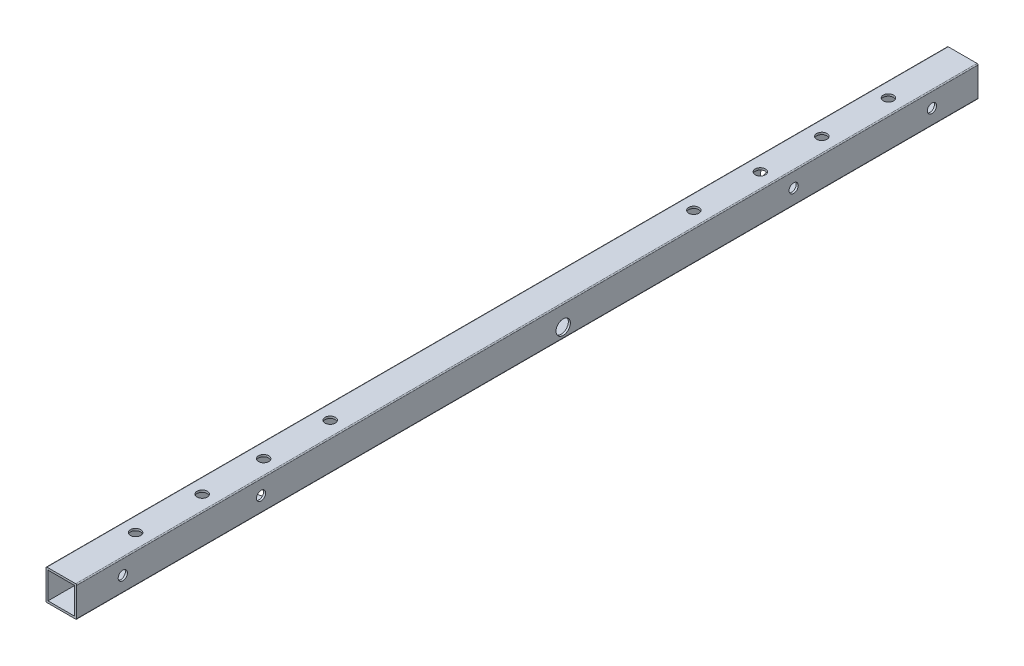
ISO-10303-21;
HEADER;
FILE_DESCRIPTION(('STEP AP214'),'2;1');
FILE_NAME('part.step','',(''),(''),'','','');
FILE_SCHEMA(('AUTOMOTIVE_DESIGN { 1 0 10303 214 1 1 1 1 }'));
ENDSEC;
DATA;
#1=APPLICATION_CONTEXT('core data for automotive mechanical design processes');
#2=APPLICATION_PROTOCOL_DEFINITION('international standard','automotive_design',2000,#1);
#3=PRODUCT_CONTEXT('',#1,'mechanical');
#4=PRODUCT('Part','Part','',(#3));
#5=PRODUCT_RELATED_PRODUCT_CATEGORY('part','',(#4));
#6=PRODUCT_DEFINITION_FORMATION('','',#4);
#7=PRODUCT_DEFINITION_CONTEXT('part definition',#1,'design');
#8=PRODUCT_DEFINITION('design','',#6,#7);
#9=PRODUCT_DEFINITION_SHAPE('','',#8);
#10=(LENGTH_UNIT() NAMED_UNIT(*) SI_UNIT(.MILLI.,.METRE.));
#11=(NAMED_UNIT(*) PLANE_ANGLE_UNIT() SI_UNIT($,.RADIAN.));
#12=(NAMED_UNIT(*) SI_UNIT($,.STERADIAN.) SOLID_ANGLE_UNIT());
#13=UNCERTAINTY_MEASURE_WITH_UNIT(LENGTH_MEASURE(1.E-05),#10,'distance_accuracy_value','');
#14=(GEOMETRIC_REPRESENTATION_CONTEXT(3) GLOBAL_UNCERTAINTY_ASSIGNED_CONTEXT((#13)) GLOBAL_UNIT_ASSIGNED_CONTEXT((#10,
#11,#12)) REPRESENTATION_CONTEXT('',''));
#15=CARTESIAN_POINT('',(0.,0.,0.));
#16=DIRECTION('',(0.,0.,1.));
#17=DIRECTION('',(1.,0.,0.));
#18=AXIS2_PLACEMENT_3D('',#15,#16,#17);
#19=CARTESIAN_POINT('',(-14.,-14.,0.));
#20=DIRECTION('',(0.,0.,-1.));
#21=DIRECTION('',(-1.,0.,0.));
#22=AXIS2_PLACEMENT_3D('',#19,#20,#21);
#23=PLANE('',#22);
#24=CARTESIAN_POINT('',(-14.,-14.,0.));
#25=DIRECTION('',(0.,0.,-1.));
#26=DIRECTION('',(-1.,0.,0.));
#27=AXIS2_PLACEMENT_3D('',#24,#25,#26);
#28=CIRCLE('',#27,0.999999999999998);
#29=CARTESIAN_POINT('',(-14.,-15.,0.));
#30=VERTEX_POINT('',#29);
#31=CARTESIAN_POINT('',(-15.,-14.,0.));
#32=VERTEX_POINT('',#31);
#33=EDGE_CURVE('E127',#30,#32,#28,.T.);
#34=ORIENTED_EDGE('',*,*,#33,.T.);
#35=DIRECTION('',(0.,-1.,0.));
#36=VECTOR('',#35,1.);
#37=CARTESIAN_POINT('',(-15.,14.,0.));
#38=LINE('',#37,#36);
#39=CARTESIAN_POINT('',(-15.,14.,0.));
#40=VERTEX_POINT('',#39);
#41=EDGE_CURVE('E163',#40,#32,#38,.T.);
#42=ORIENTED_EDGE('',*,*,#41,.F.);
#43=CARTESIAN_POINT('',(-14.,14.,0.));
#44=DIRECTION('',(0.,0.,-1.));
#45=DIRECTION('',(-1.,0.,0.));
#46=AXIS2_PLACEMENT_3D('',#43,#44,#45);
#47=CIRCLE('',#46,0.999999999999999);
#48=CARTESIAN_POINT('',(-14.,15.,0.));
#49=VERTEX_POINT('',#48);
#50=EDGE_CURVE('E166',#40,#49,#47,.T.);
#51=ORIENTED_EDGE('',*,*,#50,.T.);
#52=DIRECTION('',(1.,0.,0.));
#53=VECTOR('',#52,1.);
#54=CARTESIAN_POINT('',(-14.,15.,0.));
#55=LINE('',#54,#53);
#56=CARTESIAN_POINT('',(14.,15.,0.));
#57=VERTEX_POINT('',#56);
#58=EDGE_CURVE('E169',#49,#57,#55,.T.);
#59=ORIENTED_EDGE('',*,*,#58,.T.);
#60=CARTESIAN_POINT('',(14.,14.,0.));
#61=DIRECTION('',(0.,0.,1.));
#62=DIRECTION('',(1.,0.,0.));
#63=AXIS2_PLACEMENT_3D('',#60,#61,#62);
#64=CIRCLE('',#63,0.999999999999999);
#65=CARTESIAN_POINT('',(15.,14.,0.));
#66=VERTEX_POINT('',#65);
#67=EDGE_CURVE('E172',#66,#57,#64,.T.);
#68=ORIENTED_EDGE('',*,*,#67,.F.);
#69=DIRECTION('',(0.,1.,0.));
#70=VECTOR('',#69,1.);
#71=CARTESIAN_POINT('',(15.,-14.,0.));
#72=LINE('',#71,#70);
#73=CARTESIAN_POINT('',(15.,-14.,0.));
#74=VERTEX_POINT('',#73);
#75=EDGE_CURVE('E175',#74,#66,#72,.T.);
#76=ORIENTED_EDGE('',*,*,#75,.F.);
#77=CARTESIAN_POINT('',(14.,-14.,0.));
#78=DIRECTION('',(0.,0.,-1.));
#79=DIRECTION('',(-1.,0.,0.));
#80=AXIS2_PLACEMENT_3D('',#77,#78,#79);
#81=CIRCLE('',#80,1.);
#82=CARTESIAN_POINT('',(14.,-15.,0.));
#83=VERTEX_POINT('',#82);
#84=EDGE_CURVE('E177',#74,#83,#81,.T.);
#85=ORIENTED_EDGE('',*,*,#84,.T.);
#86=DIRECTION('',(-1.,0.,0.));
#87=VECTOR('',#86,1.);
#88=CARTESIAN_POINT('',(14.,-15.,0.));
#89=LINE('',#88,#87);
#90=EDGE_CURVE('E180',#83,#30,#89,.T.);
#91=ORIENTED_EDGE('',*,*,#90,.T.);
#92=EDGE_LOOP('',(#34,#42,#51,#59,#68,#76,#85,#91));
#93=FACE_BOUND('',#92,.T.);
#94=DIRECTION('',(1.,0.,0.));
#95=VECTOR('',#94,1.);
#96=CARTESIAN_POINT('',(-14.,13.,0.));
#97=LINE('',#96,#95);
#98=CARTESIAN_POINT('',(-13.,13.,0.));
#99=VERTEX_POINT('',#98);
#100=CARTESIAN_POINT('',(13.,13.,0.));
#101=VERTEX_POINT('',#100);
#102=EDGE_CURVE('E139',#99,#101,#97,.T.);
#103=ORIENTED_EDGE('',*,*,#102,.F.);
#104=DIRECTION('',(0.,-1.,0.));
#105=VECTOR('',#104,1.);
#106=CARTESIAN_POINT('',(-13.,-14.,0.));
#107=LINE('',#106,#105);
#108=CARTESIAN_POINT('',(-13.,-13.,0.));
#109=VERTEX_POINT('',#108);
#110=EDGE_CURVE('E55',#99,#109,#107,.T.);
#111=ORIENTED_EDGE('',*,*,#110,.T.);
#112=DIRECTION('',(-1.,0.,0.));
#113=VECTOR('',#112,1.);
#114=CARTESIAN_POINT('',(-14.,-13.,0.));
#115=LINE('',#114,#113);
#116=CARTESIAN_POINT('',(13.,-13.,0.));
#117=VERTEX_POINT('',#116);
#118=EDGE_CURVE('E131',#117,#109,#115,.T.);
#119=ORIENTED_EDGE('',*,*,#118,.F.);
#120=DIRECTION('',(0.,1.,0.));
#121=VECTOR('',#120,1.);
#122=CARTESIAN_POINT('',(13.,-14.,0.));
#123=LINE('',#122,#121);
#124=EDGE_CURVE('E136',#117,#101,#123,.T.);
#125=ORIENTED_EDGE('',*,*,#124,.T.);
#126=EDGE_LOOP('',(#103,#111,#119,#125));
#127=FACE_BOUND('',#126,.T.);
#128=ADVANCED_FACE('F30',(#93,#127),#23,.T.);
#129=CARTESIAN_POINT('',(-14.,-14.,880.));
#130=DIRECTION('',(0.,0.,-1.));
#131=DIRECTION('',(-1.,0.,0.));
#132=AXIS2_PLACEMENT_3D('',#129,#130,#131);
#133=CYLINDRICAL_SURFACE('',#132,0.999999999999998);
#134=ORIENTED_EDGE('',*,*,#33,.F.);
#135=DIRECTION('',(0.,0.,-1.));
#136=VECTOR('',#135,1.);
#137=CARTESIAN_POINT('',(-14.,-15.,880.));
#138=LINE('',#137,#136);
#139=CARTESIAN_POINT('',(-14.,-15.,880.));
#140=VERTEX_POINT('',#139);
#141=EDGE_CURVE('E11',#140,#30,#138,.T.);
#142=ORIENTED_EDGE('',*,*,#141,.F.);
#143=CARTESIAN_POINT('',(-14.,-14.,880.));
#144=DIRECTION('',(0.,0.,-1.));
#145=DIRECTION('',(-1.,0.,0.));
#146=AXIS2_PLACEMENT_3D('',#143,#144,#145);
#147=CIRCLE('',#146,0.999999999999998);
#148=CARTESIAN_POINT('',(-15.,-14.,880.));
#149=VERTEX_POINT('',#148);
#150=EDGE_CURVE('E183',#140,#149,#147,.T.);
#151=ORIENTED_EDGE('',*,*,#150,.T.);
#152=DIRECTION('',(0.,0.,-1.));
#153=VECTOR('',#152,1.);
#154=CARTESIAN_POINT('',(-15.,-14.,880.));
#155=LINE('',#154,#153);
#156=EDGE_CURVE('E203',#149,#32,#155,.T.);
#157=ORIENTED_EDGE('',*,*,#156,.T.);
#158=EDGE_LOOP('',(#134,#142,#151,#157));
#159=FACE_BOUND('',#158,.T.);
#160=ADVANCED_FACE('F32',(#159),#133,.T.);
#161=CARTESIAN_POINT('',(14.,-15.,880.));
#162=DIRECTION('',(0.,-1.,0.));
#163=DIRECTION('',(1.,0.,0.));
#164=AXIS2_PLACEMENT_3D('',#161,#162,#163);
#165=PLANE('',#164);
#166=CARTESIAN_POINT('',(0.,-15.,682.5));
#167=DIRECTION('',(0.,-1.,0.));
#168=DIRECTION('',(1.,0.,0.));
#169=AXIS2_PLACEMENT_3D('',#166,#167,#168);
#170=CIRCLE('',#169,5.);
#171=CARTESIAN_POINT('',(5.00000000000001,-15.,682.5));
#172=VERTEX_POINT('',#171);
#173=EDGE_CURVE('E302',#172,#172,#170,.T.);
#174=ORIENTED_EDGE('',*,*,#173,.F.);
#175=EDGE_LOOP('',(#174));
#176=FACE_BOUND('',#175,.T.);
#177=CARTESIAN_POINT('',(0.,-15.,617.5));
#178=DIRECTION('',(0.,-1.,0.));
#179=DIRECTION('',(1.,0.,0.));
#180=AXIS2_PLACEMENT_3D('',#177,#178,#179);
#181=CIRCLE('',#180,5.);
#182=CARTESIAN_POINT('',(5.00000000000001,-15.,617.5));
#183=VERTEX_POINT('',#182);
#184=EDGE_CURVE('E309',#183,#183,#181,.T.);
#185=ORIENTED_EDGE('',*,*,#184,.F.);
#186=EDGE_LOOP('',(#185));
#187=FACE_BOUND('',#186,.T.);
#188=CARTESIAN_POINT('',(0.,-15.,262.5));
#189=DIRECTION('',(0.,-1.,0.));
#190=DIRECTION('',(1.,0.,0.));
#191=AXIS2_PLACEMENT_3D('',#188,#189,#190);
#192=CIRCLE('',#191,5.);
#193=CARTESIAN_POINT('',(5.00000000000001,-15.,262.5));
#194=VERTEX_POINT('',#193);
#195=EDGE_CURVE('E316',#194,#194,#192,.T.);
#196=ORIENTED_EDGE('',*,*,#195,.F.);
#197=EDGE_LOOP('',(#196));
#198=FACE_BOUND('',#197,.T.);
#199=CARTESIAN_POINT('',(0.,-15.,197.5));
#200=DIRECTION('',(0.,-1.,0.));
#201=DIRECTION('',(1.,0.,0.));
#202=AXIS2_PLACEMENT_3D('',#199,#200,#201);
#203=CIRCLE('',#202,5.);
#204=CARTESIAN_POINT('',(5.00000000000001,-15.,197.5));
#205=VERTEX_POINT('',#204);
#206=EDGE_CURVE('E323',#205,#205,#203,.T.);
#207=ORIENTED_EDGE('',*,*,#206,.F.);
#208=EDGE_LOOP('',(#207));
#209=FACE_BOUND('',#208,.T.);
#210=CARTESIAN_POINT('',(0.,-15.,807.5));
#211=DIRECTION('',(0.,-1.,0.));
#212=DIRECTION('',(1.,0.,0.));
#213=AXIS2_PLACEMENT_3D('',#210,#211,#212);
#214=CIRCLE('',#213,5.);
#215=CARTESIAN_POINT('',(5.00000000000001,-15.,807.5));
#216=VERTEX_POINT('',#215);
#217=EDGE_CURVE('E330',#216,#216,#214,.T.);
#218=ORIENTED_EDGE('',*,*,#217,.F.);
#219=EDGE_LOOP('',(#218));
#220=FACE_BOUND('',#219,.T.);
#221=CARTESIAN_POINT('',(0.,-15.,742.5));
#222=DIRECTION('',(0.,-1.,0.));
#223=DIRECTION('',(1.,0.,0.));
#224=AXIS2_PLACEMENT_3D('',#221,#222,#223);
#225=CIRCLE('',#224,5.);
#226=CARTESIAN_POINT('',(5.00000000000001,-15.,742.5));
#227=VERTEX_POINT('',#226);
#228=EDGE_CURVE('E337',#227,#227,#225,.T.);
#229=ORIENTED_EDGE('',*,*,#228,.F.);
#230=EDGE_LOOP('',(#229));
#231=FACE_BOUND('',#230,.T.);
#232=CARTESIAN_POINT('',(0.,-15.,137.5));
#233=DIRECTION('',(0.,-1.,0.));
#234=DIRECTION('',(1.,0.,0.));
#235=AXIS2_PLACEMENT_3D('',#232,#233,#234);
#236=CIRCLE('',#235,5.);
#237=CARTESIAN_POINT('',(5.00000000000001,-15.,137.5));
#238=VERTEX_POINT('',#237);
#239=EDGE_CURVE('E344',#238,#238,#236,.T.);
#240=ORIENTED_EDGE('',*,*,#239,.F.);
#241=EDGE_LOOP('',(#240));
#242=FACE_BOUND('',#241,.T.);
#243=CARTESIAN_POINT('',(0.,-15.,72.5));
#244=DIRECTION('',(0.,-1.,0.));
#245=DIRECTION('',(1.,0.,0.));
#246=AXIS2_PLACEMENT_3D('',#243,#244,#245);
#247=CIRCLE('',#246,5.);
#248=CARTESIAN_POINT('',(5.00000000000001,-15.,72.5));
#249=VERTEX_POINT('',#248);
#250=EDGE_CURVE('E140',#249,#249,#247,.T.);
#251=ORIENTED_EDGE('',*,*,#250,.F.);
#252=EDGE_LOOP('',(#251));
#253=FACE_BOUND('',#252,.T.);
#254=ORIENTED_EDGE('',*,*,#90,.F.);
#255=DIRECTION('',(0.,0.,-1.));
#256=VECTOR('',#255,1.);
#257=CARTESIAN_POINT('',(14.,-15.,880.));
#258=LINE('',#257,#256);
#259=CARTESIAN_POINT('',(14.,-15.,880.));
#260=VERTEX_POINT('',#259);
#261=EDGE_CURVE('E39',#260,#83,#258,.T.);
#262=ORIENTED_EDGE('',*,*,#261,.F.);
#263=DIRECTION('',(-1.,0.,0.));
#264=VECTOR('',#263,1.);
#265=CARTESIAN_POINT('',(14.,-15.,880.));
#266=LINE('',#265,#264);
#267=EDGE_CURVE('E201',#260,#140,#266,.T.);
#268=ORIENTED_EDGE('',*,*,#267,.T.);
#269=ORIENTED_EDGE('',*,*,#141,.T.);
#270=EDGE_LOOP('',(#254,#262,#268,#269));
#271=FACE_BOUND('',#270,.T.);
#272=ADVANCED_FACE('F374',(#176,#187,#198,#209,#220,#231,#242,#253,#271),#165,.T.);
#273=CARTESIAN_POINT('',(14.,-14.,880.));
#274=DIRECTION('',(0.,0.,-1.));
#275=DIRECTION('',(-1.,0.,0.));
#276=AXIS2_PLACEMENT_3D('',#273,#274,#275);
#277=CYLINDRICAL_SURFACE('',#276,1.);
#278=ORIENTED_EDGE('',*,*,#84,.F.);
#279=DIRECTION('',(0.,0.,-1.));
#280=VECTOR('',#279,1.);
#281=CARTESIAN_POINT('',(15.,-14.,880.));
#282=LINE('',#281,#280);
#283=CARTESIAN_POINT('',(15.,-14.,880.));
#284=VERTEX_POINT('',#283);
#285=EDGE_CURVE('E206',#284,#74,#282,.T.);
#286=ORIENTED_EDGE('',*,*,#285,.F.);
#287=CARTESIAN_POINT('',(14.,-14.,880.));
#288=DIRECTION('',(0.,0.,-1.));
#289=DIRECTION('',(-1.,0.,0.));
#290=AXIS2_PLACEMENT_3D('',#287,#288,#289);
#291=CIRCLE('',#290,1.);
#292=EDGE_CURVE('E198',#284,#260,#291,.T.);
#293=ORIENTED_EDGE('',*,*,#292,.T.);
#294=ORIENTED_EDGE('',*,*,#261,.T.);
#295=EDGE_LOOP('',(#278,#286,#293,#294));
#296=FACE_BOUND('',#295,.T.);
#297=ADVANCED_FACE('F386',(#296),#277,.T.);
#298=CARTESIAN_POINT('',(15.,-14.,880.));
#299=DIRECTION('',(-1.,0.,0.));
#300=DIRECTION('',(0.,-1.,0.));
#301=AXIS2_PLACEMENT_3D('',#298,#299,#300);
#302=PLANE('',#301);
#303=CARTESIAN_POINT('',(15.,-5.,405.));
#304=DIRECTION('',(1.,0.,0.));
#305=DIRECTION('',(0.,1.,0.));
#306=AXIS2_PLACEMENT_3D('',#303,#304,#305);
#307=CIRCLE('',#306,6.99999999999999);
#308=CARTESIAN_POINT('',(15.,1.99999999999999,405.));
#309=VERTEX_POINT('',#308);
#310=EDGE_CURVE('E704',#309,#309,#307,.T.);
#311=ORIENTED_EDGE('',*,*,#310,.F.);
#312=EDGE_LOOP('',(#311));
#313=FACE_BOUND('',#312,.T.);
#314=CARTESIAN_POINT('',(15.,0.,180.));
#315=DIRECTION('',(-1.,0.,0.));
#316=DIRECTION('',(0.,-1.,0.));
#317=AXIS2_PLACEMENT_3D('',#314,#315,#316);
#318=CIRCLE('',#317,4.49999999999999);
#319=CARTESIAN_POINT('',(15.,-4.49999999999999,180.));
#320=VERTEX_POINT('',#319);
#321=EDGE_CURVE('E713',#320,#320,#318,.T.);
#322=ORIENTED_EDGE('',*,*,#321,.T.);
#323=EDGE_LOOP('',(#322));
#324=FACE_BOUND('',#323,.T.);
#325=CARTESIAN_POINT('',(15.,0.,45.));
#326=DIRECTION('',(-1.,0.,0.));
#327=DIRECTION('',(0.,-1.,0.));
#328=AXIS2_PLACEMENT_3D('',#325,#326,#327);
#329=CIRCLE('',#328,4.5);
#330=CARTESIAN_POINT('',(15.,-4.5,45.));
#331=VERTEX_POINT('',#330);
#332=EDGE_CURVE('E269',#331,#331,#329,.T.);
#333=ORIENTED_EDGE('',*,*,#332,.T.);
#334=EDGE_LOOP('',(#333));
#335=FACE_BOUND('',#334,.T.);
#336=CARTESIAN_POINT('',(15.,0.,700.));
#337=DIRECTION('',(-1.,0.,0.));
#338=DIRECTION('',(0.,-1.,0.));
#339=AXIS2_PLACEMENT_3D('',#336,#337,#338);
#340=CIRCLE('',#339,4.49999999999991);
#341=CARTESIAN_POINT('',(15.,-4.49999999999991,700.));
#342=VERTEX_POINT('',#341);
#343=EDGE_CURVE('E265',#342,#342,#340,.T.);
#344=ORIENTED_EDGE('',*,*,#343,.T.);
#345=EDGE_LOOP('',(#344));
#346=FACE_BOUND('',#345,.T.);
#347=CARTESIAN_POINT('',(15.,0.,835.));
#348=DIRECTION('',(-1.,0.,0.));
#349=DIRECTION('',(0.,-1.,0.));
#350=AXIS2_PLACEMENT_3D('',#347,#348,#349);
#351=CIRCLE('',#350,4.49999999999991);
#352=CARTESIAN_POINT('',(15.,-4.49999999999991,835.));
#353=VERTEX_POINT('',#352);
#354=EDGE_CURVE('E261',#353,#353,#351,.T.);
#355=ORIENTED_EDGE('',*,*,#354,.T.);
#356=EDGE_LOOP('',(#355));
#357=FACE_BOUND('',#356,.T.);
#358=ORIENTED_EDGE('',*,*,#75,.T.);
#359=DIRECTION('',(0.,0.,-1.));
#360=VECTOR('',#359,1.);
#361=CARTESIAN_POINT('',(15.,14.,880.));
#362=LINE('',#361,#360);
#363=CARTESIAN_POINT('',(15.,14.,880.));
#364=VERTEX_POINT('',#363);
#365=EDGE_CURVE('E208',#364,#66,#362,.T.);
#366=ORIENTED_EDGE('',*,*,#365,.F.);
#367=DIRECTION('',(0.,1.,0.));
#368=VECTOR('',#367,1.);
#369=CARTESIAN_POINT('',(15.,-14.,880.));
#370=LINE('',#369,#368);
#371=EDGE_CURVE('E196',#284,#364,#370,.T.);
#372=ORIENTED_EDGE('',*,*,#371,.F.);
#373=ORIENTED_EDGE('',*,*,#285,.T.);
#374=EDGE_LOOP('',(#358,#366,#372,#373));
#375=FACE_BOUND('',#374,.T.);
#376=ADVANCED_FACE('F390',(#313,#324,#335,#346,#357,#375),#302,.F.);
#377=CARTESIAN_POINT('',(14.,14.,880.));
#378=DIRECTION('',(0.,0.,-1.));
#379=DIRECTION('',(-1.,0.,0.));
#380=AXIS2_PLACEMENT_3D('',#377,#378,#379);
#381=CYLINDRICAL_SURFACE('',#380,0.999999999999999);
#382=ORIENTED_EDGE('',*,*,#67,.T.);
#383=DIRECTION('',(0.,0.,-1.));
#384=VECTOR('',#383,1.);
#385=CARTESIAN_POINT('',(14.,15.,880.));
#386=LINE('',#385,#384);
#387=CARTESIAN_POINT('',(14.,15.,880.));
#388=VERTEX_POINT('',#387);
#389=EDGE_CURVE('E211',#388,#57,#386,.T.);
#390=ORIENTED_EDGE('',*,*,#389,.F.);
#391=CARTESIAN_POINT('',(14.,14.,880.));
#392=DIRECTION('',(0.,0.,1.));
#393=DIRECTION('',(1.,0.,0.));
#394=AXIS2_PLACEMENT_3D('',#391,#392,#393);
#395=CIRCLE('',#394,0.999999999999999);
#396=EDGE_CURVE('E194',#364,#388,#395,.T.);
#397=ORIENTED_EDGE('',*,*,#396,.F.);
#398=ORIENTED_EDGE('',*,*,#365,.T.);
#399=EDGE_LOOP('',(#382,#390,#397,#398));
#400=FACE_BOUND('',#399,.T.);
#401=ADVANCED_FACE('F394',(#400),#381,.T.);
#402=CARTESIAN_POINT('',(-14.,15.,880.));
#403=DIRECTION('',(0.,1.,0.));
#404=DIRECTION('',(0.,0.,1.));
#405=AXIS2_PLACEMENT_3D('',#402,#403,#404);
#406=PLANE('',#405);
#407=CARTESIAN_POINT('',(0.,15.,682.5));
#408=DIRECTION('',(0.,1.,0.));
#409=DIRECTION('',(0.,0.,1.));
#410=AXIS2_PLACEMENT_3D('',#407,#408,#409);
#411=CIRCLE('',#410,5.);
#412=CARTESIAN_POINT('',(0.,15.,687.5));
#413=VERTEX_POINT('',#412);
#414=EDGE_CURVE('E256',#413,#413,#411,.T.);
#415=ORIENTED_EDGE('',*,*,#414,.F.);
#416=EDGE_LOOP('',(#415));
#417=FACE_BOUND('',#416,.T.);
#418=CARTESIAN_POINT('',(0.,15.,617.5));
#419=DIRECTION('',(0.,1.,0.));
#420=DIRECTION('',(0.,0.,1.));
#421=AXIS2_PLACEMENT_3D('',#418,#419,#420);
#422=CIRCLE('',#421,5.);
#423=CARTESIAN_POINT('',(0.,15.,622.5));
#424=VERTEX_POINT('',#423);
#425=EDGE_CURVE('E251',#424,#424,#422,.T.);
#426=ORIENTED_EDGE('',*,*,#425,.F.);
#427=EDGE_LOOP('',(#426));
#428=FACE_BOUND('',#427,.T.);
#429=CARTESIAN_POINT('',(0.,15.,262.5));
#430=DIRECTION('',(0.,1.,0.));
#431=DIRECTION('',(0.,0.,1.));
#432=AXIS2_PLACEMENT_3D('',#429,#430,#431);
#433=CIRCLE('',#432,5.);
#434=CARTESIAN_POINT('',(0.,15.,267.5));
#435=VERTEX_POINT('',#434);
#436=EDGE_CURVE('E246',#435,#435,#433,.T.);
#437=ORIENTED_EDGE('',*,*,#436,.F.);
#438=EDGE_LOOP('',(#437));
#439=FACE_BOUND('',#438,.T.);
#440=CARTESIAN_POINT('',(0.,15.,197.5));
#441=DIRECTION('',(0.,1.,0.));
#442=DIRECTION('',(0.,0.,1.));
#443=AXIS2_PLACEMENT_3D('',#440,#441,#442);
#444=CIRCLE('',#443,5.);
#445=CARTESIAN_POINT('',(0.,15.,202.5));
#446=VERTEX_POINT('',#445);
#447=EDGE_CURVE('E241',#446,#446,#444,.T.);
#448=ORIENTED_EDGE('',*,*,#447,.F.);
#449=EDGE_LOOP('',(#448));
#450=FACE_BOUND('',#449,.T.);
#451=CARTESIAN_POINT('',(0.,15.,807.5));
#452=DIRECTION('',(0.,1.,0.));
#453=DIRECTION('',(0.,0.,1.));
#454=AXIS2_PLACEMENT_3D('',#451,#452,#453);
#455=CIRCLE('',#454,5.);
#456=CARTESIAN_POINT('',(0.,15.,812.5));
#457=VERTEX_POINT('',#456);
#458=EDGE_CURVE('E236',#457,#457,#455,.T.);
#459=ORIENTED_EDGE('',*,*,#458,.F.);
#460=EDGE_LOOP('',(#459));
#461=FACE_BOUND('',#460,.T.);
#462=CARTESIAN_POINT('',(0.,15.,742.5));
#463=DIRECTION('',(0.,1.,0.));
#464=DIRECTION('',(0.,0.,1.));
#465=AXIS2_PLACEMENT_3D('',#462,#463,#464);
#466=CIRCLE('',#465,5.);
#467=CARTESIAN_POINT('',(0.,15.,747.5));
#468=VERTEX_POINT('',#467);
#469=EDGE_CURVE('E231',#468,#468,#466,.T.);
#470=ORIENTED_EDGE('',*,*,#469,.F.);
#471=EDGE_LOOP('',(#470));
#472=FACE_BOUND('',#471,.T.);
#473=CARTESIAN_POINT('',(0.,15.,137.5));
#474=DIRECTION('',(0.,1.,0.));
#475=DIRECTION('',(0.,0.,1.));
#476=AXIS2_PLACEMENT_3D('',#473,#474,#475);
#477=CIRCLE('',#476,5.);
#478=CARTESIAN_POINT('',(0.,15.,142.5));
#479=VERTEX_POINT('',#478);
#480=EDGE_CURVE('E226',#479,#479,#477,.T.);
#481=ORIENTED_EDGE('',*,*,#480,.F.);
#482=EDGE_LOOP('',(#481));
#483=FACE_BOUND('',#482,.T.);
#484=CARTESIAN_POINT('',(0.,15.,72.5));
#485=DIRECTION('',(0.,1.,0.));
#486=DIRECTION('',(0.,0.,1.));
#487=AXIS2_PLACEMENT_3D('',#484,#485,#486);
#488=CIRCLE('',#487,5.);
#489=CARTESIAN_POINT('',(0.,15.,77.5));
#490=VERTEX_POINT('',#489);
#491=EDGE_CURVE('E221',#490,#490,#488,.T.);
#492=ORIENTED_EDGE('',*,*,#491,.F.);
#493=EDGE_LOOP('',(#492));
#494=FACE_BOUND('',#493,.T.);
#495=ORIENTED_EDGE('',*,*,#58,.F.);
#496=DIRECTION('',(0.,0.,-1.));
#497=VECTOR('',#496,1.);
#498=CARTESIAN_POINT('',(-14.,15.,880.));
#499=LINE('',#498,#497);
#500=CARTESIAN_POINT('',(-14.,15.,880.));
#501=VERTEX_POINT('',#500);
#502=EDGE_CURVE('E213',#501,#49,#499,.T.);
#503=ORIENTED_EDGE('',*,*,#502,.F.);
#504=DIRECTION('',(1.,0.,0.));
#505=VECTOR('',#504,1.);
#506=CARTESIAN_POINT('',(-14.,15.,880.));
#507=LINE('',#506,#505);
#508=EDGE_CURVE('E191',#501,#388,#507,.T.);
#509=ORIENTED_EDGE('',*,*,#508,.T.);
#510=ORIENTED_EDGE('',*,*,#389,.T.);
#511=EDGE_LOOP('',(#495,#503,#509,#510));
#512=FACE_BOUND('',#511,.T.);
#513=ADVANCED_FACE('F398',(#417,#428,#439,#450,#461,#472,#483,#494,#512),#406,.T.);
#514=CARTESIAN_POINT('',(-14.,14.,880.));
#515=DIRECTION('',(0.,0.,-1.));
#516=DIRECTION('',(-1.,0.,0.));
#517=AXIS2_PLACEMENT_3D('',#514,#515,#516);
#518=CYLINDRICAL_SURFACE('',#517,0.999999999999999);
#519=ORIENTED_EDGE('',*,*,#50,.F.);
#520=DIRECTION('',(0.,0.,-1.));
#521=VECTOR('',#520,1.);
#522=CARTESIAN_POINT('',(-15.,14.,880.));
#523=LINE('',#522,#521);
#524=CARTESIAN_POINT('',(-15.,14.,880.));
#525=VERTEX_POINT('',#524);
#526=EDGE_CURVE('E215',#525,#40,#523,.T.);
#527=ORIENTED_EDGE('',*,*,#526,.F.);
#528=CARTESIAN_POINT('',(-14.,14.,880.));
#529=DIRECTION('',(0.,0.,-1.));
#530=DIRECTION('',(-1.,0.,0.));
#531=AXIS2_PLACEMENT_3D('',#528,#529,#530);
#532=CIRCLE('',#531,0.999999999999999);
#533=EDGE_CURVE('E188',#525,#501,#532,.T.);
#534=ORIENTED_EDGE('',*,*,#533,.T.);
#535=ORIENTED_EDGE('',*,*,#502,.T.);
#536=EDGE_LOOP('',(#519,#527,#534,#535));
#537=FACE_BOUND('',#536,.T.);
#538=ADVANCED_FACE('F402',(#537),#518,.T.);
#539=CARTESIAN_POINT('',(-15.,14.,880.));
#540=DIRECTION('',(1.,0.,0.));
#541=DIRECTION('',(0.,1.,0.));
#542=AXIS2_PLACEMENT_3D('',#539,#540,#541);
#543=PLANE('',#542);
#544=CARTESIAN_POINT('',(-15.,-5.,405.));
#545=DIRECTION('',(-1.,0.,0.));
#546=DIRECTION('',(0.,-1.,0.));
#547=AXIS2_PLACEMENT_3D('',#544,#545,#546);
#548=CIRCLE('',#547,4.50000000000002);
#549=CARTESIAN_POINT('',(-15.,-9.50000000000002,405.));
#550=VERTEX_POINT('',#549);
#551=EDGE_CURVE('E413',#550,#550,#548,.T.);
#552=ORIENTED_EDGE('',*,*,#551,.F.);
#553=EDGE_LOOP('',(#552));
#554=FACE_BOUND('',#553,.T.);
#555=CARTESIAN_POINT('',(-15.,0.,180.));
#556=DIRECTION('',(-1.,0.,0.));
#557=DIRECTION('',(0.,-1.,0.));
#558=AXIS2_PLACEMENT_3D('',#555,#556,#557);
#559=CIRCLE('',#558,4.49999999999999);
#560=CARTESIAN_POINT('',(-15.,-4.49999999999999,180.));
#561=VERTEX_POINT('',#560);
#562=EDGE_CURVE('E417',#561,#561,#559,.T.);
#563=ORIENTED_EDGE('',*,*,#562,.F.);
#564=EDGE_LOOP('',(#563));
#565=FACE_BOUND('',#564,.T.);
#566=CARTESIAN_POINT('',(-15.,0.,45.));
#567=DIRECTION('',(-1.,0.,0.));
#568=DIRECTION('',(0.,-1.,0.));
#569=AXIS2_PLACEMENT_3D('',#566,#567,#568);
#570=CIRCLE('',#569,4.5);
#571=CARTESIAN_POINT('',(-15.,-4.49999999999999,45.));
#572=VERTEX_POINT('',#571);
#573=EDGE_CURVE('E276',#572,#572,#570,.T.);
#574=ORIENTED_EDGE('',*,*,#573,.F.);
#575=EDGE_LOOP('',(#574));
#576=FACE_BOUND('',#575,.T.);
#577=CARTESIAN_POINT('',(-15.,0.,700.));
#578=DIRECTION('',(-1.,0.,0.));
#579=DIRECTION('',(0.,-1.,0.));
#580=AXIS2_PLACEMENT_3D('',#577,#578,#579);
#581=CIRCLE('',#580,4.49999999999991);
#582=CARTESIAN_POINT('',(-15.,-4.4999999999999,700.));
#583=VERTEX_POINT('',#582);
#584=EDGE_CURVE('E273',#583,#583,#581,.T.);
#585=ORIENTED_EDGE('',*,*,#584,.F.);
#586=EDGE_LOOP('',(#585));
#587=FACE_BOUND('',#586,.T.);
#588=CARTESIAN_POINT('',(-15.,0.,835.));
#589=DIRECTION('',(-1.,0.,0.));
#590=DIRECTION('',(0.,-1.,0.));
#591=AXIS2_PLACEMENT_3D('',#588,#589,#590);
#592=CIRCLE('',#591,4.49999999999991);
#593=CARTESIAN_POINT('',(-15.,-4.4999999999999,835.));
#594=VERTEX_POINT('',#593);
#595=EDGE_CURVE('E291',#594,#594,#592,.T.);
#596=ORIENTED_EDGE('',*,*,#595,.F.);
#597=EDGE_LOOP('',(#596));
#598=FACE_BOUND('',#597,.T.);
#599=ORIENTED_EDGE('',*,*,#41,.T.);
#600=ORIENTED_EDGE('',*,*,#156,.F.);
#601=DIRECTION('',(0.,-1.,0.));
#602=VECTOR('',#601,1.);
#603=CARTESIAN_POINT('',(-15.,14.,880.));
#604=LINE('',#603,#602);
#605=EDGE_CURVE('E186',#525,#149,#604,.T.);
#606=ORIENTED_EDGE('',*,*,#605,.F.);
#607=ORIENTED_EDGE('',*,*,#526,.T.);
#608=EDGE_LOOP('',(#599,#600,#606,#607));
#609=FACE_BOUND('',#608,.T.);
#610=ADVANCED_FACE('F382',(#554,#565,#576,#587,#598,#609),#543,.F.);
#611=CARTESIAN_POINT('',(-14.,-14.,880.));
#612=DIRECTION('',(0.,0.,-1.));
#613=DIRECTION('',(-1.,0.,0.));
#614=AXIS2_PLACEMENT_3D('',#611,#612,#613);
#615=PLANE('',#614);
#616=DIRECTION('',(0.,1.,0.));
#617=VECTOR('',#616,1.);
#618=CARTESIAN_POINT('',(13.,-14.,880.));
#619=LINE('',#618,#617);
#620=CARTESIAN_POINT('',(13.,-13.,880.));
#621=VERTEX_POINT('',#620);
#622=CARTESIAN_POINT('',(13.,13.,880.));
#623=VERTEX_POINT('',#622);
#624=EDGE_CURVE('E152',#621,#623,#619,.T.);
#625=ORIENTED_EDGE('',*,*,#624,.F.);
#626=DIRECTION('',(-1.,0.,0.));
#627=VECTOR('',#626,1.);
#628=CARTESIAN_POINT('',(-14.,-13.,880.));
#629=LINE('',#628,#627);
#630=CARTESIAN_POINT('',(-13.,-13.,880.));
#631=VERTEX_POINT('',#630);
#632=EDGE_CURVE('E150',#621,#631,#629,.T.);
#633=ORIENTED_EDGE('',*,*,#632,.T.);
#634=DIRECTION('',(0.,-1.,0.));
#635=VECTOR('',#634,1.);
#636=CARTESIAN_POINT('',(-13.,-14.,880.));
#637=LINE('',#636,#635);
#638=CARTESIAN_POINT('',(-13.,13.,880.));
#639=VERTEX_POINT('',#638);
#640=EDGE_CURVE('E123',#639,#631,#637,.T.);
#641=ORIENTED_EDGE('',*,*,#640,.F.);
#642=DIRECTION('',(1.,0.,0.));
#643=VECTOR('',#642,1.);
#644=CARTESIAN_POINT('',(-14.,13.,880.));
#645=LINE('',#644,#643);
#646=EDGE_CURVE('E154',#639,#623,#645,.T.);
#647=ORIENTED_EDGE('',*,*,#646,.T.);
#648=EDGE_LOOP('',(#625,#633,#641,#647));
#649=FACE_BOUND('',#648,.T.);
#650=ORIENTED_EDGE('',*,*,#150,.F.);
#651=ORIENTED_EDGE('',*,*,#267,.F.);
#652=ORIENTED_EDGE('',*,*,#292,.F.);
#653=ORIENTED_EDGE('',*,*,#371,.T.);
#654=ORIENTED_EDGE('',*,*,#396,.T.);
#655=ORIENTED_EDGE('',*,*,#508,.F.);
#656=ORIENTED_EDGE('',*,*,#533,.F.);
#657=ORIENTED_EDGE('',*,*,#605,.T.);
#658=EDGE_LOOP('',(#650,#651,#652,#653,#654,#655,#656,#657));
#659=FACE_BOUND('',#658,.T.);
#660=ADVANCED_FACE('F379',(#649,#659),#615,.F.);
#661=CARTESIAN_POINT('',(-13.,-14.,880.));
#662=DIRECTION('',(1.,0.,0.));
#663=DIRECTION('',(0.,1.,0.));
#664=AXIS2_PLACEMENT_3D('',#661,#662,#663);
#665=PLANE('',#664);
#666=CARTESIAN_POINT('',(-13.,-5.,405.));
#667=DIRECTION('',(1.,0.,0.));
#668=DIRECTION('',(0.,1.,0.));
#669=AXIS2_PLACEMENT_3D('',#666,#667,#668);
#670=CIRCLE('',#669,4.50000000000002);
#671=CARTESIAN_POINT('',(-13.,-0.49999999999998,405.));
#672=VERTEX_POINT('',#671);
#673=EDGE_CURVE('E709',#672,#672,#670,.T.);
#674=ORIENTED_EDGE('',*,*,#673,.F.);
#675=EDGE_LOOP('',(#674));
#676=FACE_BOUND('',#675,.T.);
#677=CARTESIAN_POINT('',(-13.,0.,180.));
#678=DIRECTION('',(1.,0.,0.));
#679=DIRECTION('',(0.,1.,0.));
#680=AXIS2_PLACEMENT_3D('',#677,#678,#679);
#681=CIRCLE('',#680,4.49999999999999);
#682=CARTESIAN_POINT('',(-13.,4.5,180.));
#683=VERTEX_POINT('',#682);
#684=EDGE_CURVE('E281',#683,#683,#681,.T.);
#685=ORIENTED_EDGE('',*,*,#684,.F.);
#686=EDGE_LOOP('',(#685));
#687=FACE_BOUND('',#686,.T.);
#688=CARTESIAN_POINT('',(-13.,0.,45.));
#689=DIRECTION('',(1.,0.,0.));
#690=DIRECTION('',(0.,1.,0.));
#691=AXIS2_PLACEMENT_3D('',#688,#689,#690);
#692=CIRCLE('',#691,4.5);
#693=CARTESIAN_POINT('',(-13.,4.5,45.));
#694=VERTEX_POINT('',#693);
#695=EDGE_CURVE('E268',#694,#694,#692,.T.);
#696=ORIENTED_EDGE('',*,*,#695,.F.);
#697=EDGE_LOOP('',(#696));
#698=FACE_BOUND('',#697,.T.);
#699=CARTESIAN_POINT('',(-13.,0.,700.));
#700=DIRECTION('',(1.,0.,0.));
#701=DIRECTION('',(0.,1.,0.));
#702=AXIS2_PLACEMENT_3D('',#699,#700,#701);
#703=CIRCLE('',#702,4.49999999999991);
#704=CARTESIAN_POINT('',(-13.,4.49999999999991,700.));
#705=VERTEX_POINT('',#704);
#706=EDGE_CURVE('E264',#705,#705,#703,.T.);
#707=ORIENTED_EDGE('',*,*,#706,.F.);
#708=EDGE_LOOP('',(#707));
#709=FACE_BOUND('',#708,.T.);
#710=CARTESIAN_POINT('',(-13.,0.,835.));
#711=DIRECTION('',(1.,0.,0.));
#712=DIRECTION('',(0.,1.,0.));
#713=AXIS2_PLACEMENT_3D('',#710,#711,#712);
#714=CIRCLE('',#713,4.49999999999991);
#715=CARTESIAN_POINT('',(-13.,4.49999999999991,835.));
#716=VERTEX_POINT('',#715);
#717=EDGE_CURVE('E260',#716,#716,#714,.T.);
#718=ORIENTED_EDGE('',*,*,#717,.F.);
#719=EDGE_LOOP('',(#718));
#720=FACE_BOUND('',#719,.T.);
#721=ORIENTED_EDGE('',*,*,#110,.F.);
#722=DIRECTION('',(0.,0.,-1.));
#723=VECTOR('',#722,1.);
#724=CARTESIAN_POINT('',(-13.,13.,880.));
#725=LINE('',#724,#723);
#726=EDGE_CURVE('E157',#639,#99,#725,.T.);
#727=ORIENTED_EDGE('',*,*,#726,.F.);
#728=ORIENTED_EDGE('',*,*,#640,.T.);
#729=DIRECTION('',(0.,0.,-1.));
#730=VECTOR('',#729,1.);
#731=CARTESIAN_POINT('',(-13.,-13.,880.));
#732=LINE('',#731,#730);
#733=EDGE_CURVE('E119',#631,#109,#732,.T.);
#734=ORIENTED_EDGE('',*,*,#733,.T.);
#735=EDGE_LOOP('',(#721,#727,#728,#734));
#736=FACE_BOUND('',#735,.T.);
#737=ADVANCED_FACE('F121',(#676,#687,#698,#709,#720,#736),#665,.T.);
#738=CARTESIAN_POINT('',(-14.,-13.,880.));
#739=DIRECTION('',(0.,-1.,0.));
#740=DIRECTION('',(1.,0.,0.));
#741=AXIS2_PLACEMENT_3D('',#738,#739,#740);
#742=PLANE('',#741);
#743=CARTESIAN_POINT('',(0.,-13.,682.5));
#744=DIRECTION('',(0.,-1.,0.));
#745=DIRECTION('',(1.,0.,0.));
#746=AXIS2_PLACEMENT_3D('',#743,#744,#745);
#747=CIRCLE('',#746,5.);
#748=CARTESIAN_POINT('',(5.00000000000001,-13.,682.5));
#749=VERTEX_POINT('',#748);
#750=EDGE_CURVE('E255',#749,#749,#747,.T.);
#751=ORIENTED_EDGE('',*,*,#750,.T.);
#752=EDGE_LOOP('',(#751));
#753=FACE_BOUND('',#752,.T.);
#754=CARTESIAN_POINT('',(0.,-13.,617.5));
#755=DIRECTION('',(0.,-1.,0.));
#756=DIRECTION('',(1.,0.,0.));
#757=AXIS2_PLACEMENT_3D('',#754,#755,#756);
#758=CIRCLE('',#757,5.);
#759=CARTESIAN_POINT('',(5.00000000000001,-13.,617.5));
#760=VERTEX_POINT('',#759);
#761=EDGE_CURVE('E250',#760,#760,#758,.T.);
#762=ORIENTED_EDGE('',*,*,#761,.T.);
#763=EDGE_LOOP('',(#762));
#764=FACE_BOUND('',#763,.T.);
#765=CARTESIAN_POINT('',(0.,-13.,262.5));
#766=DIRECTION('',(0.,-1.,0.));
#767=DIRECTION('',(1.,0.,0.));
#768=AXIS2_PLACEMENT_3D('',#765,#766,#767);
#769=CIRCLE('',#768,5.);
#770=CARTESIAN_POINT('',(5.00000000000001,-13.,262.5));
#771=VERTEX_POINT('',#770);
#772=EDGE_CURVE('E245',#771,#771,#769,.T.);
#773=ORIENTED_EDGE('',*,*,#772,.T.);
#774=EDGE_LOOP('',(#773));
#775=FACE_BOUND('',#774,.T.);
#776=CARTESIAN_POINT('',(0.,-13.,197.5));
#777=DIRECTION('',(0.,-1.,0.));
#778=DIRECTION('',(1.,0.,0.));
#779=AXIS2_PLACEMENT_3D('',#776,#777,#778);
#780=CIRCLE('',#779,5.);
#781=CARTESIAN_POINT('',(5.00000000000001,-13.,197.5));
#782=VERTEX_POINT('',#781);
#783=EDGE_CURVE('E240',#782,#782,#780,.T.);
#784=ORIENTED_EDGE('',*,*,#783,.T.);
#785=EDGE_LOOP('',(#784));
#786=FACE_BOUND('',#785,.T.);
#787=CARTESIAN_POINT('',(0.,-13.,807.5));
#788=DIRECTION('',(0.,-1.,0.));
#789=DIRECTION('',(1.,0.,0.));
#790=AXIS2_PLACEMENT_3D('',#787,#788,#789);
#791=CIRCLE('',#790,5.);
#792=CARTESIAN_POINT('',(5.00000000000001,-13.,807.5));
#793=VERTEX_POINT('',#792);
#794=EDGE_CURVE('E235',#793,#793,#791,.T.);
#795=ORIENTED_EDGE('',*,*,#794,.T.);
#796=EDGE_LOOP('',(#795));
#797=FACE_BOUND('',#796,.T.);
#798=CARTESIAN_POINT('',(0.,-13.,742.5));
#799=DIRECTION('',(0.,-1.,0.));
#800=DIRECTION('',(1.,0.,0.));
#801=AXIS2_PLACEMENT_3D('',#798,#799,#800);
#802=CIRCLE('',#801,5.);
#803=CARTESIAN_POINT('',(5.00000000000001,-13.,742.5));
#804=VERTEX_POINT('',#803);
#805=EDGE_CURVE('E230',#804,#804,#802,.T.);
#806=ORIENTED_EDGE('',*,*,#805,.T.);
#807=EDGE_LOOP('',(#806));
#808=FACE_BOUND('',#807,.T.);
#809=CARTESIAN_POINT('',(0.,-13.,137.5));
#810=DIRECTION('',(0.,-1.,0.));
#811=DIRECTION('',(1.,0.,0.));
#812=AXIS2_PLACEMENT_3D('',#809,#810,#811);
#813=CIRCLE('',#812,5.);
#814=CARTESIAN_POINT('',(5.00000000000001,-13.,137.5));
#815=VERTEX_POINT('',#814);
#816=EDGE_CURVE('E225',#815,#815,#813,.T.);
#817=ORIENTED_EDGE('',*,*,#816,.T.);
#818=EDGE_LOOP('',(#817));
#819=FACE_BOUND('',#818,.T.);
#820=CARTESIAN_POINT('',(0.,-13.,72.5));
#821=DIRECTION('',(0.,-1.,0.));
#822=DIRECTION('',(1.,0.,0.));
#823=AXIS2_PLACEMENT_3D('',#820,#821,#822);
#824=CIRCLE('',#823,5.);
#825=CARTESIAN_POINT('',(5.00000000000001,-13.,72.5));
#826=VERTEX_POINT('',#825);
#827=EDGE_CURVE('E143',#826,#826,#824,.T.);
#828=ORIENTED_EDGE('',*,*,#827,.T.);
#829=EDGE_LOOP('',(#828));
#830=FACE_BOUND('',#829,.T.);
#831=ORIENTED_EDGE('',*,*,#118,.T.);
#832=ORIENTED_EDGE('',*,*,#733,.F.);
#833=ORIENTED_EDGE('',*,*,#632,.F.);
#834=DIRECTION('',(0.,0.,-1.));
#835=VECTOR('',#834,1.);
#836=CARTESIAN_POINT('',(13.,-13.,880.));
#837=LINE('',#836,#835);
#838=EDGE_CURVE('E128',#621,#117,#837,.T.);
#839=ORIENTED_EDGE('',*,*,#838,.T.);
#840=EDGE_LOOP('',(#831,#832,#833,#839));
#841=FACE_BOUND('',#840,.T.);
#842=ADVANCED_FACE('F132',(#753,#764,#775,#786,#797,#808,#819,#830,#841),#742,.F.);
#843=CARTESIAN_POINT('',(13.,-14.,880.));
#844=DIRECTION('',(-1.,0.,0.));
#845=DIRECTION('',(0.,-1.,0.));
#846=AXIS2_PLACEMENT_3D('',#843,#844,#845);
#847=PLANE('',#846);
#848=CARTESIAN_POINT('',(13.,-5.,405.));
#849=DIRECTION('',(-1.,0.,0.));
#850=DIRECTION('',(0.,-1.,0.));
#851=AXIS2_PLACEMENT_3D('',#848,#849,#850);
#852=CIRCLE('',#851,6.99999999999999);
#853=CARTESIAN_POINT('',(13.,-12.,405.));
#854=VERTEX_POINT('',#853);
#855=EDGE_CURVE('E701',#854,#854,#852,.T.);
#856=ORIENTED_EDGE('',*,*,#855,.F.);
#857=EDGE_LOOP('',(#856));
#858=FACE_BOUND('',#857,.T.);
#859=CARTESIAN_POINT('',(13.,0.,180.));
#860=DIRECTION('',(-1.,0.,0.));
#861=DIRECTION('',(0.,-1.,0.));
#862=AXIS2_PLACEMENT_3D('',#859,#860,#861);
#863=CIRCLE('',#862,4.49999999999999);
#864=CARTESIAN_POINT('',(13.,-4.49999999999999,180.));
#865=VERTEX_POINT('',#864);
#866=EDGE_CURVE('E34',#865,#865,#863,.T.);
#867=ORIENTED_EDGE('',*,*,#866,.F.);
#868=EDGE_LOOP('',(#867));
#869=FACE_BOUND('',#868,.T.);
#870=CARTESIAN_POINT('',(13.,0.,45.));
#871=DIRECTION('',(-1.,0.,0.));
#872=DIRECTION('',(0.,-1.,0.));
#873=AXIS2_PLACEMENT_3D('',#870,#871,#872);
#874=CIRCLE('',#873,4.5);
#875=CARTESIAN_POINT('',(13.,-4.5,45.));
#876=VERTEX_POINT('',#875);
#877=EDGE_CURVE('E266',#876,#876,#874,.T.);
#878=ORIENTED_EDGE('',*,*,#877,.F.);
#879=EDGE_LOOP('',(#878));
#880=FACE_BOUND('',#879,.T.);
#881=CARTESIAN_POINT('',(13.,0.,700.));
#882=DIRECTION('',(-1.,0.,0.));
#883=DIRECTION('',(0.,-1.,0.));
#884=AXIS2_PLACEMENT_3D('',#881,#882,#883);
#885=CIRCLE('',#884,4.49999999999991);
#886=CARTESIAN_POINT('',(13.,-4.49999999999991,700.));
#887=VERTEX_POINT('',#886);
#888=EDGE_CURVE('E262',#887,#887,#885,.T.);
#889=ORIENTED_EDGE('',*,*,#888,.F.);
#890=EDGE_LOOP('',(#889));
#891=FACE_BOUND('',#890,.T.);
#892=CARTESIAN_POINT('',(13.,0.,835.));
#893=DIRECTION('',(-1.,0.,0.));
#894=DIRECTION('',(0.,-1.,0.));
#895=AXIS2_PLACEMENT_3D('',#892,#893,#894);
#896=CIRCLE('',#895,4.49999999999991);
#897=CARTESIAN_POINT('',(13.,-4.49999999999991,835.));
#898=VERTEX_POINT('',#897);
#899=EDGE_CURVE('E257',#898,#898,#896,.T.);
#900=ORIENTED_EDGE('',*,*,#899,.F.);
#901=EDGE_LOOP('',(#900));
#902=FACE_BOUND('',#901,.T.);
#903=ORIENTED_EDGE('',*,*,#124,.F.);
#904=ORIENTED_EDGE('',*,*,#838,.F.);
#905=ORIENTED_EDGE('',*,*,#624,.T.);
#906=DIRECTION('',(0.,0.,-1.));
#907=VECTOR('',#906,1.);
#908=CARTESIAN_POINT('',(13.,13.,880.));
#909=LINE('',#908,#907);
#910=EDGE_CURVE('E47',#623,#101,#909,.T.);
#911=ORIENTED_EDGE('',*,*,#910,.T.);
#912=EDGE_LOOP('',(#903,#904,#905,#911));
#913=FACE_BOUND('',#912,.T.);
#914=ADVANCED_FACE('F504',(#858,#869,#880,#891,#902,#913),#847,.T.);
#915=CARTESIAN_POINT('',(-14.,13.,880.));
#916=DIRECTION('',(0.,1.,0.));
#917=DIRECTION('',(0.,0.,1.));
#918=AXIS2_PLACEMENT_3D('',#915,#916,#917);
#919=PLANE('',#918);
#920=CARTESIAN_POINT('',(0.,13.,682.5));
#921=DIRECTION('',(0.,1.,0.));
#922=DIRECTION('',(0.,0.,1.));
#923=AXIS2_PLACEMENT_3D('',#920,#921,#922);
#924=CIRCLE('',#923,5.);
#925=CARTESIAN_POINT('',(0.,13.,687.5));
#926=VERTEX_POINT('',#925);
#927=EDGE_CURVE('E252',#926,#926,#924,.T.);
#928=ORIENTED_EDGE('',*,*,#927,.T.);
#929=EDGE_LOOP('',(#928));
#930=FACE_BOUND('',#929,.T.);
#931=CARTESIAN_POINT('',(0.,13.,617.5));
#932=DIRECTION('',(0.,1.,0.));
#933=DIRECTION('',(0.,0.,1.));
#934=AXIS2_PLACEMENT_3D('',#931,#932,#933);
#935=CIRCLE('',#934,5.);
#936=CARTESIAN_POINT('',(0.,13.,622.5));
#937=VERTEX_POINT('',#936);
#938=EDGE_CURVE('E247',#937,#937,#935,.T.);
#939=ORIENTED_EDGE('',*,*,#938,.T.);
#940=EDGE_LOOP('',(#939));
#941=FACE_BOUND('',#940,.T.);
#942=CARTESIAN_POINT('',(0.,13.,262.5));
#943=DIRECTION('',(0.,1.,0.));
#944=DIRECTION('',(0.,0.,1.));
#945=AXIS2_PLACEMENT_3D('',#942,#943,#944);
#946=CIRCLE('',#945,5.);
#947=CARTESIAN_POINT('',(0.,13.,267.5));
#948=VERTEX_POINT('',#947);
#949=EDGE_CURVE('E242',#948,#948,#946,.T.);
#950=ORIENTED_EDGE('',*,*,#949,.T.);
#951=EDGE_LOOP('',(#950));
#952=FACE_BOUND('',#951,.T.);
#953=CARTESIAN_POINT('',(0.,13.,197.5));
#954=DIRECTION('',(0.,1.,0.));
#955=DIRECTION('',(0.,0.,1.));
#956=AXIS2_PLACEMENT_3D('',#953,#954,#955);
#957=CIRCLE('',#956,5.);
#958=CARTESIAN_POINT('',(0.,13.,202.5));
#959=VERTEX_POINT('',#958);
#960=EDGE_CURVE('E237',#959,#959,#957,.T.);
#961=ORIENTED_EDGE('',*,*,#960,.T.);
#962=EDGE_LOOP('',(#961));
#963=FACE_BOUND('',#962,.T.);
#964=CARTESIAN_POINT('',(0.,13.,807.5));
#965=DIRECTION('',(0.,1.,0.));
#966=DIRECTION('',(0.,0.,1.));
#967=AXIS2_PLACEMENT_3D('',#964,#965,#966);
#968=CIRCLE('',#967,5.);
#969=CARTESIAN_POINT('',(0.,13.,812.5));
#970=VERTEX_POINT('',#969);
#971=EDGE_CURVE('E232',#970,#970,#968,.T.);
#972=ORIENTED_EDGE('',*,*,#971,.T.);
#973=EDGE_LOOP('',(#972));
#974=FACE_BOUND('',#973,.T.);
#975=CARTESIAN_POINT('',(0.,13.,742.5));
#976=DIRECTION('',(0.,1.,0.));
#977=DIRECTION('',(0.,0.,1.));
#978=AXIS2_PLACEMENT_3D('',#975,#976,#977);
#979=CIRCLE('',#978,5.);
#980=CARTESIAN_POINT('',(0.,13.,747.5));
#981=VERTEX_POINT('',#980);
#982=EDGE_CURVE('E227',#981,#981,#979,.T.);
#983=ORIENTED_EDGE('',*,*,#982,.T.);
#984=EDGE_LOOP('',(#983));
#985=FACE_BOUND('',#984,.T.);
#986=CARTESIAN_POINT('',(0.,13.,137.5));
#987=DIRECTION('',(0.,1.,0.));
#988=DIRECTION('',(0.,0.,1.));
#989=AXIS2_PLACEMENT_3D('',#986,#987,#988);
#990=CIRCLE('',#989,5.);
#991=CARTESIAN_POINT('',(0.,13.,142.5));
#992=VERTEX_POINT('',#991);
#993=EDGE_CURVE('E222',#992,#992,#990,.T.);
#994=ORIENTED_EDGE('',*,*,#993,.T.);
#995=EDGE_LOOP('',(#994));
#996=FACE_BOUND('',#995,.T.);
#997=CARTESIAN_POINT('',(0.,13.,72.5));
#998=DIRECTION('',(0.,1.,0.));
#999=DIRECTION('',(0.,0.,1.));
#1000=AXIS2_PLACEMENT_3D('',#997,#998,#999);
#1001=CIRCLE('',#1000,5.);
#1002=CARTESIAN_POINT('',(0.,13.,77.5));
#1003=VERTEX_POINT('',#1002);
#1004=EDGE_CURVE('E218',#1003,#1003,#1001,.T.);
#1005=ORIENTED_EDGE('',*,*,#1004,.T.);
#1006=EDGE_LOOP('',(#1005));
#1007=FACE_BOUND('',#1006,.T.);
#1008=ORIENTED_EDGE('',*,*,#102,.T.);
#1009=ORIENTED_EDGE('',*,*,#910,.F.);
#1010=ORIENTED_EDGE('',*,*,#646,.F.);
#1011=ORIENTED_EDGE('',*,*,#726,.T.);
#1012=EDGE_LOOP('',(#1008,#1009,#1010,#1011));
#1013=FACE_BOUND('',#1012,.T.);
#1014=ADVANCED_FACE('F365',(#930,#941,#952,#963,#974,#985,#996,#1007,#1013),#919,.F.);
#1015=CARTESIAN_POINT('',(0.,-20.,72.5));
#1016=DIRECTION('',(0.,1.,0.));
#1017=DIRECTION('',(0.,0.,1.));
#1018=AXIS2_PLACEMENT_3D('',#1015,#1016,#1017);
#1019=CYLINDRICAL_SURFACE('',#1018,5.);
#1020=ORIENTED_EDGE('',*,*,#491,.T.);
#1021=EDGE_LOOP('',(#1020));
#1022=FACE_BOUND('',#1021,.T.);
#1023=ORIENTED_EDGE('',*,*,#1004,.F.);
#1024=EDGE_LOOP('',(#1023));
#1025=FACE_BOUND('',#1024,.T.);
#1026=ADVANCED_FACE('F355',(#1022,#1025),#1019,.F.);
#1027=ORIENTED_EDGE('',*,*,#250,.T.);
#1028=EDGE_LOOP('',(#1027));
#1029=FACE_BOUND('',#1028,.T.);
#1030=ORIENTED_EDGE('',*,*,#827,.F.);
#1031=EDGE_LOOP('',(#1030));
#1032=FACE_BOUND('',#1031,.T.);
#1033=ADVANCED_FACE('F352',(#1029,#1032),#1019,.F.);
#1034=CARTESIAN_POINT('',(0.,-20.,137.5));
#1035=DIRECTION('',(0.,1.,0.));
#1036=DIRECTION('',(0.,0.,1.));
#1037=AXIS2_PLACEMENT_3D('',#1034,#1035,#1036);
#1038=CYLINDRICAL_SURFACE('',#1037,5.);
#1039=ORIENTED_EDGE('',*,*,#480,.T.);
#1040=EDGE_LOOP('',(#1039));
#1041=FACE_BOUND('',#1040,.T.);
#1042=ORIENTED_EDGE('',*,*,#993,.F.);
#1043=EDGE_LOOP('',(#1042));
#1044=FACE_BOUND('',#1043,.T.);
#1045=ADVANCED_FACE('F354',(#1041,#1044),#1038,.F.);
#1046=ORIENTED_EDGE('',*,*,#239,.T.);
#1047=EDGE_LOOP('',(#1046));
#1048=FACE_BOUND('',#1047,.T.);
#1049=ORIENTED_EDGE('',*,*,#816,.F.);
#1050=EDGE_LOOP('',(#1049));
#1051=FACE_BOUND('',#1050,.T.);
#1052=ADVANCED_FACE('F362',(#1048,#1051),#1038,.F.);
#1053=CARTESIAN_POINT('',(0.,-20.,742.5));
#1054=DIRECTION('',(0.,1.,0.));
#1055=DIRECTION('',(0.,0.,1.));
#1056=AXIS2_PLACEMENT_3D('',#1053,#1054,#1055);
#1057=CYLINDRICAL_SURFACE('',#1056,5.);
#1058=ORIENTED_EDGE('',*,*,#469,.T.);
#1059=EDGE_LOOP('',(#1058));
#1060=FACE_BOUND('',#1059,.T.);
#1061=ORIENTED_EDGE('',*,*,#982,.F.);
#1062=EDGE_LOOP('',(#1061));
#1063=FACE_BOUND('',#1062,.T.);
#1064=ADVANCED_FACE('F491',(#1060,#1063),#1057,.F.);
#1065=ORIENTED_EDGE('',*,*,#228,.T.);
#1066=EDGE_LOOP('',(#1065));
#1067=FACE_BOUND('',#1066,.T.);
#1068=ORIENTED_EDGE('',*,*,#805,.F.);
#1069=EDGE_LOOP('',(#1068));
#1070=FACE_BOUND('',#1069,.T.);
#1071=ADVANCED_FACE('F489',(#1067,#1070),#1057,.F.);
#1072=CARTESIAN_POINT('',(0.,-20.,807.5));
#1073=DIRECTION('',(0.,1.,0.));
#1074=DIRECTION('',(0.,0.,1.));
#1075=AXIS2_PLACEMENT_3D('',#1072,#1073,#1074);
#1076=CYLINDRICAL_SURFACE('',#1075,5.);
#1077=ORIENTED_EDGE('',*,*,#458,.T.);
#1078=EDGE_LOOP('',(#1077));
#1079=FACE_BOUND('',#1078,.T.);
#1080=ORIENTED_EDGE('',*,*,#971,.F.);
#1081=EDGE_LOOP('',(#1080));
#1082=FACE_BOUND('',#1081,.T.);
#1083=ADVANCED_FACE('F487',(#1079,#1082),#1076,.F.);
#1084=ORIENTED_EDGE('',*,*,#217,.T.);
#1085=EDGE_LOOP('',(#1084));
#1086=FACE_BOUND('',#1085,.T.);
#1087=ORIENTED_EDGE('',*,*,#794,.F.);
#1088=EDGE_LOOP('',(#1087));
#1089=FACE_BOUND('',#1088,.T.);
#1090=ADVANCED_FACE('F484',(#1086,#1089),#1076,.F.);
#1091=CARTESIAN_POINT('',(0.,-20.,197.5));
#1092=DIRECTION('',(0.,1.,0.));
#1093=DIRECTION('',(0.,0.,1.));
#1094=AXIS2_PLACEMENT_3D('',#1091,#1092,#1093);
#1095=CYLINDRICAL_SURFACE('',#1094,5.);
#1096=ORIENTED_EDGE('',*,*,#447,.T.);
#1097=EDGE_LOOP('',(#1096));
#1098=FACE_BOUND('',#1097,.T.);
#1099=ORIENTED_EDGE('',*,*,#960,.F.);
#1100=EDGE_LOOP('',(#1099));
#1101=FACE_BOUND('',#1100,.T.);
#1102=ADVANCED_FACE('F482',(#1098,#1101),#1095,.F.);
#1103=ORIENTED_EDGE('',*,*,#206,.T.);
#1104=EDGE_LOOP('',(#1103));
#1105=FACE_BOUND('',#1104,.T.);
#1106=ORIENTED_EDGE('',*,*,#783,.F.);
#1107=EDGE_LOOP('',(#1106));
#1108=FACE_BOUND('',#1107,.T.);
#1109=ADVANCED_FACE('F479',(#1105,#1108),#1095,.F.);
#1110=CARTESIAN_POINT('',(0.,-20.,262.5));
#1111=DIRECTION('',(0.,1.,0.));
#1112=DIRECTION('',(0.,0.,1.));
#1113=AXIS2_PLACEMENT_3D('',#1110,#1111,#1112);
#1114=CYLINDRICAL_SURFACE('',#1113,5.);
#1115=ORIENTED_EDGE('',*,*,#436,.T.);
#1116=EDGE_LOOP('',(#1115));
#1117=FACE_BOUND('',#1116,.T.);
#1118=ORIENTED_EDGE('',*,*,#949,.F.);
#1119=EDGE_LOOP('',(#1118));
#1120=FACE_BOUND('',#1119,.T.);
#1121=ADVANCED_FACE('F477',(#1117,#1120),#1114,.F.);
#1122=ORIENTED_EDGE('',*,*,#195,.T.);
#1123=EDGE_LOOP('',(#1122));
#1124=FACE_BOUND('',#1123,.T.);
#1125=ORIENTED_EDGE('',*,*,#772,.F.);
#1126=EDGE_LOOP('',(#1125));
#1127=FACE_BOUND('',#1126,.T.);
#1128=ADVANCED_FACE('F474',(#1124,#1127),#1114,.F.);
#1129=CARTESIAN_POINT('',(0.,-20.,617.5));
#1130=DIRECTION('',(0.,1.,0.));
#1131=DIRECTION('',(0.,0.,1.));
#1132=AXIS2_PLACEMENT_3D('',#1129,#1130,#1131);
#1133=CYLINDRICAL_SURFACE('',#1132,5.);
#1134=ORIENTED_EDGE('',*,*,#425,.T.);
#1135=EDGE_LOOP('',(#1134));
#1136=FACE_BOUND('',#1135,.T.);
#1137=ORIENTED_EDGE('',*,*,#938,.F.);
#1138=EDGE_LOOP('',(#1137));
#1139=FACE_BOUND('',#1138,.T.);
#1140=ADVANCED_FACE('F472',(#1136,#1139),#1133,.F.);
#1141=ORIENTED_EDGE('',*,*,#184,.T.);
#1142=EDGE_LOOP('',(#1141));
#1143=FACE_BOUND('',#1142,.T.);
#1144=ORIENTED_EDGE('',*,*,#761,.F.);
#1145=EDGE_LOOP('',(#1144));
#1146=FACE_BOUND('',#1145,.T.);
#1147=ADVANCED_FACE('F469',(#1143,#1146),#1133,.F.);
#1148=CARTESIAN_POINT('',(0.,-20.,682.5));
#1149=DIRECTION('',(0.,1.,0.));
#1150=DIRECTION('',(0.,0.,1.));
#1151=AXIS2_PLACEMENT_3D('',#1148,#1149,#1150);
#1152=CYLINDRICAL_SURFACE('',#1151,5.);
#1153=ORIENTED_EDGE('',*,*,#414,.T.);
#1154=EDGE_LOOP('',(#1153));
#1155=FACE_BOUND('',#1154,.T.);
#1156=ORIENTED_EDGE('',*,*,#927,.F.);
#1157=EDGE_LOOP('',(#1156));
#1158=FACE_BOUND('',#1157,.T.);
#1159=ADVANCED_FACE('F467',(#1155,#1158),#1152,.F.);
#1160=ORIENTED_EDGE('',*,*,#173,.T.);
#1161=EDGE_LOOP('',(#1160));
#1162=FACE_BOUND('',#1161,.T.);
#1163=ORIENTED_EDGE('',*,*,#750,.F.);
#1164=EDGE_LOOP('',(#1163));
#1165=FACE_BOUND('',#1164,.T.);
#1166=ADVANCED_FACE('F461',(#1162,#1165),#1152,.F.);
#1167=CARTESIAN_POINT('',(15.,0.,835.));
#1168=DIRECTION('',(-1.,0.,0.));
#1169=DIRECTION('',(0.,-1.,0.));
#1170=AXIS2_PLACEMENT_3D('',#1167,#1168,#1169);
#1171=CYLINDRICAL_SURFACE('',#1170,4.49999999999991);
#1172=ORIENTED_EDGE('',*,*,#899,.T.);
#1173=EDGE_LOOP('',(#1172));
#1174=FACE_BOUND('',#1173,.T.);
#1175=ORIENTED_EDGE('',*,*,#354,.F.);
#1176=EDGE_LOOP('',(#1175));
#1177=FACE_BOUND('',#1176,.T.);
#1178=ADVANCED_FACE('F451',(#1174,#1177),#1171,.F.);
#1179=ORIENTED_EDGE('',*,*,#717,.T.);
#1180=EDGE_LOOP('',(#1179));
#1181=FACE_BOUND('',#1180,.T.);
#1182=ORIENTED_EDGE('',*,*,#595,.T.);
#1183=EDGE_LOOP('',(#1182));
#1184=FACE_BOUND('',#1183,.T.);
#1185=ADVANCED_FACE('F448',(#1181,#1184),#1171,.F.);
#1186=CARTESIAN_POINT('',(15.,0.,700.));
#1187=DIRECTION('',(-1.,0.,0.));
#1188=DIRECTION('',(0.,-1.,0.));
#1189=AXIS2_PLACEMENT_3D('',#1186,#1187,#1188);
#1190=CYLINDRICAL_SURFACE('',#1189,4.49999999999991);
#1191=ORIENTED_EDGE('',*,*,#888,.T.);
#1192=EDGE_LOOP('',(#1191));
#1193=FACE_BOUND('',#1192,.T.);
#1194=ORIENTED_EDGE('',*,*,#343,.F.);
#1195=EDGE_LOOP('',(#1194));
#1196=FACE_BOUND('',#1195,.T.);
#1197=ADVANCED_FACE('F450',(#1193,#1196),#1190,.F.);
#1198=ORIENTED_EDGE('',*,*,#706,.T.);
#1199=EDGE_LOOP('',(#1198));
#1200=FACE_BOUND('',#1199,.T.);
#1201=ORIENTED_EDGE('',*,*,#584,.T.);
#1202=EDGE_LOOP('',(#1201));
#1203=FACE_BOUND('',#1202,.T.);
#1204=ADVANCED_FACE('F458',(#1200,#1203),#1190,.F.);
#1205=CARTESIAN_POINT('',(15.,0.,45.));
#1206=DIRECTION('',(-1.,0.,0.));
#1207=DIRECTION('',(0.,-1.,0.));
#1208=AXIS2_PLACEMENT_3D('',#1205,#1206,#1207);
#1209=CYLINDRICAL_SURFACE('',#1208,4.5);
#1210=ORIENTED_EDGE('',*,*,#877,.T.);
#1211=EDGE_LOOP('',(#1210));
#1212=FACE_BOUND('',#1211,.T.);
#1213=ORIENTED_EDGE('',*,*,#332,.F.);
#1214=EDGE_LOOP('',(#1213));
#1215=FACE_BOUND('',#1214,.T.);
#1216=ADVANCED_FACE('F623',(#1212,#1215),#1209,.F.);
#1217=ORIENTED_EDGE('',*,*,#695,.T.);
#1218=EDGE_LOOP('',(#1217));
#1219=FACE_BOUND('',#1218,.T.);
#1220=ORIENTED_EDGE('',*,*,#573,.T.);
#1221=EDGE_LOOP('',(#1220));
#1222=FACE_BOUND('',#1221,.T.);
#1223=ADVANCED_FACE('F632',(#1219,#1222),#1209,.F.);
#1224=CARTESIAN_POINT('',(15.,0.,180.));
#1225=DIRECTION('',(-1.,0.,0.));
#1226=DIRECTION('',(0.,-1.,0.));
#1227=AXIS2_PLACEMENT_3D('',#1224,#1225,#1226);
#1228=CYLINDRICAL_SURFACE('',#1227,4.49999999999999);
#1229=ORIENTED_EDGE('',*,*,#866,.T.);
#1230=EDGE_LOOP('',(#1229));
#1231=FACE_BOUND('',#1230,.T.);
#1232=ORIENTED_EDGE('',*,*,#321,.F.);
#1233=EDGE_LOOP('',(#1232));
#1234=FACE_BOUND('',#1233,.T.);
#1235=ADVANCED_FACE('F640',(#1231,#1234),#1228,.F.);
#1236=ORIENTED_EDGE('',*,*,#684,.T.);
#1237=EDGE_LOOP('',(#1236));
#1238=FACE_BOUND('',#1237,.T.);
#1239=ORIENTED_EDGE('',*,*,#562,.T.);
#1240=EDGE_LOOP('',(#1239));
#1241=FACE_BOUND('',#1240,.T.);
#1242=ADVANCED_FACE('F649',(#1238,#1241),#1228,.F.);
#1243=CARTESIAN_POINT('',(15.,-5.,405.));
#1244=DIRECTION('',(-1.,0.,0.));
#1245=DIRECTION('',(0.,-1.,0.));
#1246=AXIS2_PLACEMENT_3D('',#1243,#1244,#1245);
#1247=CYLINDRICAL_SURFACE('',#1246,4.50000000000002);
#1248=ORIENTED_EDGE('',*,*,#673,.T.);
#1249=EDGE_LOOP('',(#1248));
#1250=FACE_BOUND('',#1249,.T.);
#1251=ORIENTED_EDGE('',*,*,#551,.T.);
#1252=EDGE_LOOP('',(#1251));
#1253=FACE_BOUND('',#1252,.T.);
#1254=ADVANCED_FACE('F659',(#1250,#1253),#1247,.F.);
#1255=CARTESIAN_POINT('',(5.00000000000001,-5.,405.));
#1256=DIRECTION('',(1.,0.,0.));
#1257=DIRECTION('',(0.,1.,0.));
#1258=AXIS2_PLACEMENT_3D('',#1255,#1256,#1257);
#1259=CYLINDRICAL_SURFACE('',#1258,6.99999999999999);
#1260=ORIENTED_EDGE('',*,*,#855,.T.);
#1261=EDGE_LOOP('',(#1260));
#1262=FACE_BOUND('',#1261,.T.);
#1263=ORIENTED_EDGE('',*,*,#310,.T.);
#1264=EDGE_LOOP('',(#1263));
#1265=FACE_BOUND('',#1264,.T.);
#1266=ADVANCED_FACE('F668',(#1262,#1265),#1259,.F.);
#1267=CLOSED_SHELL('',(#128,#160,#272,#297,#376,#401,#513,#538,#610,#660,#737,#842,#914,#1014,
#1026,#1033,#1045,#1052,#1064,#1071,#1083,#1090,#1102,#1109,#1121,#1128,#1140,#1147,#1159,#1166,
#1178,#1185,#1197,#1204,#1216,#1223,#1235,#1242,#1254,#1266));
#1268=MANIFOLD_SOLID_BREP('B2',#1267);
#1269=ADVANCED_BREP_SHAPE_REPRESENTATION('',(#18,#1268),#14);
#1270=SHAPE_DEFINITION_REPRESENTATION(#9,#1269);
ENDSEC;
END-ISO-10303-21;
